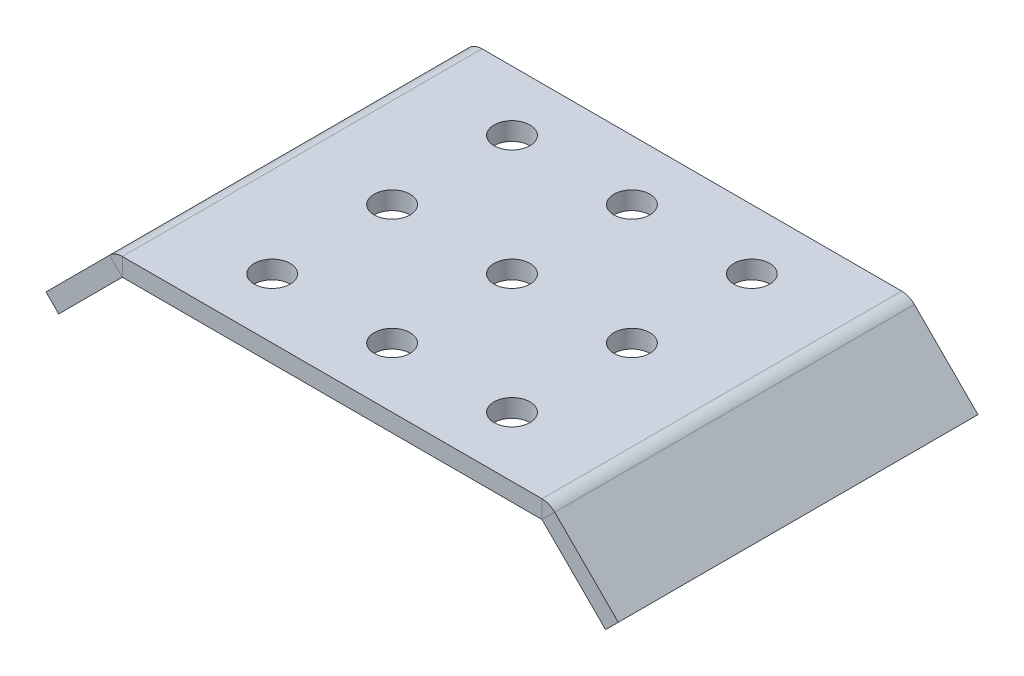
ISO-10303-21;
HEADER;
FILE_DESCRIPTION(('STEP AP214'),'2;1');
FILE_NAME('part.step','',(''),(''),'','','');
FILE_SCHEMA(('AUTOMOTIVE_DESIGN { 1 0 10303 214 1 1 1 1 }'));
ENDSEC;
DATA;
#1=APPLICATION_CONTEXT('core data for automotive mechanical design processes');
#2=APPLICATION_PROTOCOL_DEFINITION('international standard','automotive_design',2000,#1);
#3=PRODUCT_CONTEXT('',#1,'mechanical');
#4=PRODUCT('Part','Part','',(#3));
#5=PRODUCT_RELATED_PRODUCT_CATEGORY('part','',(#4));
#6=PRODUCT_DEFINITION_FORMATION('','',#4);
#7=PRODUCT_DEFINITION_CONTEXT('part definition',#1,'design');
#8=PRODUCT_DEFINITION('design','',#6,#7);
#9=PRODUCT_DEFINITION_SHAPE('','',#8);
#10=(LENGTH_UNIT() NAMED_UNIT(*) SI_UNIT(.MILLI.,.METRE.));
#11=(NAMED_UNIT(*) PLANE_ANGLE_UNIT() SI_UNIT($,.RADIAN.));
#12=(NAMED_UNIT(*) SI_UNIT($,.STERADIAN.) SOLID_ANGLE_UNIT());
#13=UNCERTAINTY_MEASURE_WITH_UNIT(LENGTH_MEASURE(1.E-05),#10,'distance_accuracy_value','');
#14=(GEOMETRIC_REPRESENTATION_CONTEXT(3) GLOBAL_UNCERTAINTY_ASSIGNED_CONTEXT((#13)) GLOBAL_UNIT_ASSIGNED_CONTEXT((#10,
#11,#12)) REPRESENTATION_CONTEXT('',''));
#15=CARTESIAN_POINT('',(0.,0.,0.));
#16=DIRECTION('',(0.,0.,1.));
#17=DIRECTION('',(1.,0.,0.));
#18=AXIS2_PLACEMENT_3D('',#15,#16,#17);
#19=CARTESIAN_POINT('',(0.,0.,-60.));
#20=DIRECTION('',(0.,-1.,0.));
#21=DIRECTION('',(0.,0.,-1.));
#22=AXIS2_PLACEMENT_3D('',#19,#20,#21);
#23=PLANE('',#22);
#24=CARTESIAN_POINT('',(50.,0.,-10.));
#25=DIRECTION('',(0.,1.,0.));
#26=DIRECTION('',(0.,0.,1.));
#27=AXIS2_PLACEMENT_3D('',#24,#25,#26);
#28=CIRCLE('',#27,3.);
#29=CARTESIAN_POINT('',(50.,0.,-7.));
#30=VERTEX_POINT('',#29);
#31=EDGE_CURVE('E237',#30,#30,#28,.T.);
#32=ORIENTED_EDGE('',*,*,#31,.T.);
#33=EDGE_LOOP('',(#32));
#34=FACE_BOUND('',#33,.T.);
#35=CARTESIAN_POINT('',(70.,0.,-50.));
#36=DIRECTION('',(0.,1.,0.));
#37=DIRECTION('',(0.,0.,1.));
#38=AXIS2_PLACEMENT_3D('',#35,#36,#37);
#39=CIRCLE('',#38,3.00000000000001);
#40=CARTESIAN_POINT('',(70.,0.,-47.));
#41=VERTEX_POINT('',#40);
#42=EDGE_CURVE('E249',#41,#41,#39,.T.);
#43=ORIENTED_EDGE('',*,*,#42,.T.);
#44=EDGE_LOOP('',(#43));
#45=FACE_BOUND('',#44,.T.);
#46=CARTESIAN_POINT('',(30.,0.,-50.));
#47=DIRECTION('',(0.,1.,0.));
#48=DIRECTION('',(0.,0.,1.));
#49=AXIS2_PLACEMENT_3D('',#46,#47,#48);
#50=CIRCLE('',#49,3.);
#51=CARTESIAN_POINT('',(30.,0.,-47.));
#52=VERTEX_POINT('',#51);
#53=EDGE_CURVE('E261',#52,#52,#50,.T.);
#54=ORIENTED_EDGE('',*,*,#53,.T.);
#55=EDGE_LOOP('',(#54));
#56=FACE_BOUND('',#55,.T.);
#57=CARTESIAN_POINT('',(50.,0.,-30.));
#58=DIRECTION('',(0.,1.,0.));
#59=DIRECTION('',(0.,0.,1.));
#60=AXIS2_PLACEMENT_3D('',#57,#58,#59);
#61=CIRCLE('',#60,3.);
#62=CARTESIAN_POINT('',(50.,0.,-27.));
#63=VERTEX_POINT('',#62);
#64=EDGE_CURVE('E273',#63,#63,#61,.T.);
#65=ORIENTED_EDGE('',*,*,#64,.T.);
#66=EDGE_LOOP('',(#65));
#67=FACE_BOUND('',#66,.T.);
#68=CARTESIAN_POINT('',(70.,0.,-30.));
#69=DIRECTION('',(0.,1.,0.));
#70=DIRECTION('',(0.,0.,1.));
#71=AXIS2_PLACEMENT_3D('',#68,#69,#70);
#72=CIRCLE('',#71,3.00000000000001);
#73=CARTESIAN_POINT('',(70.,0.,-27.));
#74=VERTEX_POINT('',#73);
#75=EDGE_CURVE('E279',#74,#74,#72,.T.);
#76=ORIENTED_EDGE('',*,*,#75,.T.);
#77=EDGE_LOOP('',(#76));
#78=FACE_BOUND('',#77,.T.);
#79=CARTESIAN_POINT('',(30.,0.,-30.));
#80=DIRECTION('',(0.,1.,0.));
#81=DIRECTION('',(0.,0.,1.));
#82=AXIS2_PLACEMENT_3D('',#79,#80,#81);
#83=CIRCLE('',#82,3.);
#84=CARTESIAN_POINT('',(30.,0.,-27.));
#85=VERTEX_POINT('',#84);
#86=EDGE_CURVE('E267',#85,#85,#83,.T.);
#87=ORIENTED_EDGE('',*,*,#86,.T.);
#88=EDGE_LOOP('',(#87));
#89=FACE_BOUND('',#88,.T.);
#90=CARTESIAN_POINT('',(50.,0.,-50.));
#91=DIRECTION('',(0.,1.,0.));
#92=DIRECTION('',(0.,0.,1.));
#93=AXIS2_PLACEMENT_3D('',#90,#91,#92);
#94=CIRCLE('',#93,3.);
#95=CARTESIAN_POINT('',(50.,0.,-47.));
#96=VERTEX_POINT('',#95);
#97=EDGE_CURVE('E255',#96,#96,#94,.T.);
#98=ORIENTED_EDGE('',*,*,#97,.T.);
#99=EDGE_LOOP('',(#98));
#100=FACE_BOUND('',#99,.T.);
#101=CARTESIAN_POINT('',(70.,0.,-10.));
#102=DIRECTION('',(0.,1.,0.));
#103=DIRECTION('',(0.,0.,1.));
#104=AXIS2_PLACEMENT_3D('',#101,#102,#103);
#105=CIRCLE('',#104,3.00000000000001);
#106=CARTESIAN_POINT('',(70.,0.,-6.99999999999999));
#107=VERTEX_POINT('',#106);
#108=EDGE_CURVE('E243',#107,#107,#105,.T.);
#109=ORIENTED_EDGE('',*,*,#108,.T.);
#110=EDGE_LOOP('',(#109));
#111=FACE_BOUND('',#110,.T.);
#112=CARTESIAN_POINT('',(30.,0.,-10.));
#113=DIRECTION('',(0.,1.,0.));
#114=DIRECTION('',(0.,0.,1.));
#115=AXIS2_PLACEMENT_3D('',#112,#113,#114);
#116=CIRCLE('',#115,3.);
#117=CARTESIAN_POINT('',(30.,0.,-7.));
#118=VERTEX_POINT('',#117);
#119=EDGE_CURVE('E229',#118,#118,#116,.T.);
#120=ORIENTED_EDGE('',*,*,#119,.T.);
#121=EDGE_LOOP('',(#120));
#122=FACE_BOUND('',#121,.T.);
#123=DIRECTION('',(-1.,0.,0.));
#124=VECTOR('',#123,1.);
#125=CARTESIAN_POINT('',(0.,0.,-60.));
#126=LINE('',#125,#124);
#127=CARTESIAN_POINT('',(84.9995955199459,0.,-60.));
#128=VERTEX_POINT('',#127);
#129=CARTESIAN_POINT('',(15.0004044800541,0.,-60.));
#130=VERTEX_POINT('',#129);
#131=EDGE_CURVE('E70',#128,#130,#126,.T.);
#132=ORIENTED_EDGE('',*,*,#131,.F.);
#133=DIRECTION('',(0.,0.,1.));
#134=VECTOR('',#133,1.);
#135=CARTESIAN_POINT('',(84.9995955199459,0.,-60.));
#136=LINE('',#135,#134);
#137=CARTESIAN_POINT('',(84.9995955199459,0.,0.));
#138=VERTEX_POINT('',#137);
#139=EDGE_CURVE('E62',#128,#138,#136,.T.);
#140=ORIENTED_EDGE('',*,*,#139,.T.);
#141=DIRECTION('',(1.,0.,0.));
#142=VECTOR('',#141,1.);
#143=CARTESIAN_POINT('',(0.,0.,0.));
#144=LINE('',#143,#142);
#145=CARTESIAN_POINT('',(15.0004044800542,0.,0.));
#146=VERTEX_POINT('',#145);
#147=EDGE_CURVE('E78',#146,#138,#144,.T.);
#148=ORIENTED_EDGE('',*,*,#147,.F.);
#149=DIRECTION('',(0.,0.,1.));
#150=VECTOR('',#149,1.);
#151=CARTESIAN_POINT('',(15.0004044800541,0.,-60.));
#152=LINE('',#151,#150);
#153=EDGE_CURVE('E293',#130,#146,#152,.T.);
#154=ORIENTED_EDGE('',*,*,#153,.F.);
#155=EDGE_LOOP('',(#132,#140,#148,#154));
#156=FACE_BOUND('',#155,.T.);
#157=ADVANCED_FACE('F53',(#34,#45,#56,#67,#78,#89,#100,#111,#122,#156),#23,.T.);
#158=CARTESIAN_POINT('',(0.,3.,-60.));
#159=DIRECTION('',(0.,0.,1.));
#160=DIRECTION('',(1.,0.,0.));
#161=AXIS2_PLACEMENT_3D('',#158,#159,#160);
#162=PLANE('',#161);
#163=DIRECTION('',(0.,1.,0.));
#164=VECTOR('',#163,1.);
#165=CARTESIAN_POINT('',(84.9995955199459,3.,-60.));
#166=LINE('',#165,#164);
#167=CARTESIAN_POINT('',(84.9995955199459,2.99999999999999,-60.));
#168=VERTEX_POINT('',#167);
#169=EDGE_CURVE('E14',#128,#168,#166,.T.);
#170=ORIENTED_EDGE('',*,*,#169,.F.);
#171=ORIENTED_EDGE('',*,*,#131,.T.);
#172=DIRECTION('',(0.,1.,0.));
#173=VECTOR('',#172,1.);
#174=CARTESIAN_POINT('',(15.0004044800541,3.,-60.));
#175=LINE('',#174,#173);
#176=CARTESIAN_POINT('',(15.0004044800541,3.,-60.));
#177=VERTEX_POINT('',#176);
#178=EDGE_CURVE('E290',#130,#177,#175,.T.);
#179=ORIENTED_EDGE('',*,*,#178,.T.);
#180=DIRECTION('',(-1.,0.,0.));
#181=VECTOR('',#180,1.);
#182=CARTESIAN_POINT('',(0.,3.,-60.));
#183=LINE('',#182,#181);
#184=EDGE_CURVE('E57',#168,#177,#183,.T.);
#185=ORIENTED_EDGE('',*,*,#184,.F.);
#186=EDGE_LOOP('',(#170,#171,#179,#185));
#187=FACE_BOUND('',#186,.T.);
#188=ADVANCED_FACE('F55',(#187),#162,.F.);
#189=CARTESIAN_POINT('',(0.,3.,0.));
#190=DIRECTION('',(0.,0.,-1.));
#191=DIRECTION('',(-1.,0.,0.));
#192=AXIS2_PLACEMENT_3D('',#189,#190,#191);
#193=PLANE('',#192);
#194=DIRECTION('',(0.,-1.,0.));
#195=VECTOR('',#194,1.);
#196=CARTESIAN_POINT('',(84.9995955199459,3.,0.));
#197=LINE('',#196,#195);
#198=CARTESIAN_POINT('',(84.9995955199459,3.,0.));
#199=VERTEX_POINT('',#198);
#200=EDGE_CURVE('E300',#199,#138,#197,.T.);
#201=ORIENTED_EDGE('',*,*,#200,.F.);
#202=DIRECTION('',(1.,0.,0.));
#203=VECTOR('',#202,1.);
#204=CARTESIAN_POINT('',(0.,3.,0.));
#205=LINE('',#204,#203);
#206=CARTESIAN_POINT('',(15.0004044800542,3.,0.));
#207=VERTEX_POINT('',#206);
#208=EDGE_CURVE('E305',#207,#199,#205,.T.);
#209=ORIENTED_EDGE('',*,*,#208,.F.);
#210=DIRECTION('',(0.,-1.,0.));
#211=VECTOR('',#210,1.);
#212=CARTESIAN_POINT('',(15.0004044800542,3.,0.));
#213=LINE('',#212,#211);
#214=EDGE_CURVE('E295',#207,#146,#213,.T.);
#215=ORIENTED_EDGE('',*,*,#214,.T.);
#216=ORIENTED_EDGE('',*,*,#147,.T.);
#217=EDGE_LOOP('',(#201,#209,#215,#216));
#218=FACE_BOUND('',#217,.T.);
#219=ADVANCED_FACE('F352',(#218),#193,.F.);
#220=CARTESIAN_POINT('',(0.,3.,-60.));
#221=DIRECTION('',(0.,-1.,0.));
#222=DIRECTION('',(0.,0.,-1.));
#223=AXIS2_PLACEMENT_3D('',#220,#221,#222);
#224=PLANE('',#223);
#225=DIRECTION('',(0.,0.,1.));
#226=VECTOR('',#225,1.);
#227=CARTESIAN_POINT('',(84.9995955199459,3.,-60.));
#228=LINE('',#227,#226);
#229=EDGE_CURVE('E297',#168,#199,#228,.T.);
#230=ORIENTED_EDGE('',*,*,#229,.F.);
#231=ORIENTED_EDGE('',*,*,#184,.T.);
#232=DIRECTION('',(0.,0.,1.));
#233=VECTOR('',#232,1.);
#234=CARTESIAN_POINT('',(15.0004044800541,3.,-60.));
#235=LINE('',#234,#233);
#236=EDGE_CURVE('E287',#177,#207,#235,.T.);
#237=ORIENTED_EDGE('',*,*,#236,.T.);
#238=ORIENTED_EDGE('',*,*,#208,.T.);
#239=EDGE_LOOP('',(#230,#231,#237,#238));
#240=FACE_BOUND('',#239,.T.);
#241=CARTESIAN_POINT('',(30.,3.,-10.));
#242=DIRECTION('',(0.,1.,0.));
#243=DIRECTION('',(0.,0.,1.));
#244=AXIS2_PLACEMENT_3D('',#241,#242,#243);
#245=CIRCLE('',#244,3.);
#246=CARTESIAN_POINT('',(30.,3.,-7.));
#247=VERTEX_POINT('',#246);
#248=EDGE_CURVE('E234',#247,#247,#245,.T.);
#249=ORIENTED_EDGE('',*,*,#248,.F.);
#250=EDGE_LOOP('',(#249));
#251=FACE_BOUND('',#250,.T.);
#252=CARTESIAN_POINT('',(70.,3.,-10.));
#253=DIRECTION('',(0.,1.,0.));
#254=DIRECTION('',(0.,0.,1.));
#255=AXIS2_PLACEMENT_3D('',#252,#253,#254);
#256=CIRCLE('',#255,3.00000000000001);
#257=CARTESIAN_POINT('',(70.,3.,-6.99999999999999));
#258=VERTEX_POINT('',#257);
#259=EDGE_CURVE('E246',#258,#258,#256,.T.);
#260=ORIENTED_EDGE('',*,*,#259,.F.);
#261=EDGE_LOOP('',(#260));
#262=FACE_BOUND('',#261,.T.);
#263=CARTESIAN_POINT('',(50.,3.,-50.));
#264=DIRECTION('',(0.,1.,0.));
#265=DIRECTION('',(0.,0.,1.));
#266=AXIS2_PLACEMENT_3D('',#263,#264,#265);
#267=CIRCLE('',#266,3.);
#268=CARTESIAN_POINT('',(50.,3.,-47.));
#269=VERTEX_POINT('',#268);
#270=EDGE_CURVE('E258',#269,#269,#267,.T.);
#271=ORIENTED_EDGE('',*,*,#270,.F.);
#272=EDGE_LOOP('',(#271));
#273=FACE_BOUND('',#272,.T.);
#274=CARTESIAN_POINT('',(30.,3.,-30.));
#275=DIRECTION('',(0.,1.,0.));
#276=DIRECTION('',(0.,0.,1.));
#277=AXIS2_PLACEMENT_3D('',#274,#275,#276);
#278=CIRCLE('',#277,3.);
#279=CARTESIAN_POINT('',(30.,3.,-27.));
#280=VERTEX_POINT('',#279);
#281=EDGE_CURVE('E270',#280,#280,#278,.T.);
#282=ORIENTED_EDGE('',*,*,#281,.F.);
#283=EDGE_LOOP('',(#282));
#284=FACE_BOUND('',#283,.T.);
#285=CARTESIAN_POINT('',(70.,3.,-30.));
#286=DIRECTION('',(0.,1.,0.));
#287=DIRECTION('',(0.,0.,1.));
#288=AXIS2_PLACEMENT_3D('',#285,#286,#287);
#289=CIRCLE('',#288,3.00000000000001);
#290=CARTESIAN_POINT('',(70.,3.,-27.));
#291=VERTEX_POINT('',#290);
#292=EDGE_CURVE('E282',#291,#291,#289,.T.);
#293=ORIENTED_EDGE('',*,*,#292,.F.);
#294=EDGE_LOOP('',(#293));
#295=FACE_BOUND('',#294,.T.);
#296=CARTESIAN_POINT('',(50.,3.,-30.));
#297=DIRECTION('',(0.,1.,0.));
#298=DIRECTION('',(0.,0.,1.));
#299=AXIS2_PLACEMENT_3D('',#296,#297,#298);
#300=CIRCLE('',#299,3.);
#301=CARTESIAN_POINT('',(50.,3.,-27.));
#302=VERTEX_POINT('',#301);
#303=EDGE_CURVE('E276',#302,#302,#300,.T.);
#304=ORIENTED_EDGE('',*,*,#303,.F.);
#305=EDGE_LOOP('',(#304));
#306=FACE_BOUND('',#305,.T.);
#307=CARTESIAN_POINT('',(30.,3.,-50.));
#308=DIRECTION('',(0.,1.,0.));
#309=DIRECTION('',(0.,0.,1.));
#310=AXIS2_PLACEMENT_3D('',#307,#308,#309);
#311=CIRCLE('',#310,3.);
#312=CARTESIAN_POINT('',(30.,3.,-47.));
#313=VERTEX_POINT('',#312);
#314=EDGE_CURVE('E264',#313,#313,#311,.T.);
#315=ORIENTED_EDGE('',*,*,#314,.F.);
#316=EDGE_LOOP('',(#315));
#317=FACE_BOUND('',#316,.T.);
#318=CARTESIAN_POINT('',(70.,3.,-50.));
#319=DIRECTION('',(0.,1.,0.));
#320=DIRECTION('',(0.,0.,1.));
#321=AXIS2_PLACEMENT_3D('',#318,#319,#320);
#322=CIRCLE('',#321,3.00000000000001);
#323=CARTESIAN_POINT('',(70.,3.,-47.));
#324=VERTEX_POINT('',#323);
#325=EDGE_CURVE('E252',#324,#324,#322,.T.);
#326=ORIENTED_EDGE('',*,*,#325,.F.);
#327=EDGE_LOOP('',(#326));
#328=FACE_BOUND('',#327,.T.);
#329=CARTESIAN_POINT('',(50.,3.,-10.));
#330=DIRECTION('',(0.,1.,0.));
#331=DIRECTION('',(0.,0.,1.));
#332=AXIS2_PLACEMENT_3D('',#329,#330,#331);
#333=CIRCLE('',#332,3.);
#334=CARTESIAN_POINT('',(50.,3.,-7.));
#335=VERTEX_POINT('',#334);
#336=EDGE_CURVE('E240',#335,#335,#333,.T.);
#337=ORIENTED_EDGE('',*,*,#336,.F.);
#338=EDGE_LOOP('',(#337));
#339=FACE_BOUND('',#338,.T.);
#340=ADVANCED_FACE('F310',(#240,#251,#262,#273,#284,#295,#306,#317,#328,#339),#224,.F.);
#341=CARTESIAN_POINT('',(70.,3.,-30.));
#342=DIRECTION('',(0.,-1.,0.));
#343=DIRECTION('',(0.,0.,-1.));
#344=AXIS2_PLACEMENT_3D('',#341,#342,#343);
#345=CYLINDRICAL_SURFACE('',#344,3.00000000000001);
#346=ORIENTED_EDGE('',*,*,#292,.T.);
#347=EDGE_LOOP('',(#346));
#348=FACE_BOUND('',#347,.T.);
#349=ORIENTED_EDGE('',*,*,#75,.F.);
#350=EDGE_LOOP('',(#349));
#351=FACE_BOUND('',#350,.T.);
#352=ADVANCED_FACE('F359',(#348,#351),#345,.F.);
#353=CARTESIAN_POINT('',(50.,3.,-30.));
#354=DIRECTION('',(0.,-1.,0.));
#355=DIRECTION('',(0.,0.,-1.));
#356=AXIS2_PLACEMENT_3D('',#353,#354,#355);
#357=CYLINDRICAL_SURFACE('',#356,3.);
#358=ORIENTED_EDGE('',*,*,#303,.T.);
#359=EDGE_LOOP('',(#358));
#360=FACE_BOUND('',#359,.T.);
#361=ORIENTED_EDGE('',*,*,#64,.F.);
#362=EDGE_LOOP('',(#361));
#363=FACE_BOUND('',#362,.T.);
#364=ADVANCED_FACE('F362',(#360,#363),#357,.F.);
#365=CARTESIAN_POINT('',(30.,3.,-30.));
#366=DIRECTION('',(0.,-1.,0.));
#367=DIRECTION('',(0.,0.,-1.));
#368=AXIS2_PLACEMENT_3D('',#365,#366,#367);
#369=CYLINDRICAL_SURFACE('',#368,3.);
#370=ORIENTED_EDGE('',*,*,#281,.T.);
#371=EDGE_LOOP('',(#370));
#372=FACE_BOUND('',#371,.T.);
#373=ORIENTED_EDGE('',*,*,#86,.F.);
#374=EDGE_LOOP('',(#373));
#375=FACE_BOUND('',#374,.T.);
#376=ADVANCED_FACE('F366',(#372,#375),#369,.F.);
#377=CARTESIAN_POINT('',(30.,3.,-50.));
#378=DIRECTION('',(0.,-1.,0.));
#379=DIRECTION('',(0.,0.,-1.));
#380=AXIS2_PLACEMENT_3D('',#377,#378,#379);
#381=CYLINDRICAL_SURFACE('',#380,3.);
#382=ORIENTED_EDGE('',*,*,#314,.T.);
#383=EDGE_LOOP('',(#382));
#384=FACE_BOUND('',#383,.T.);
#385=ORIENTED_EDGE('',*,*,#53,.F.);
#386=EDGE_LOOP('',(#385));
#387=FACE_BOUND('',#386,.T.);
#388=ADVANCED_FACE('F370',(#384,#387),#381,.F.);
#389=CARTESIAN_POINT('',(50.,3.,-50.));
#390=DIRECTION('',(0.,-1.,0.));
#391=DIRECTION('',(0.,0.,-1.));
#392=AXIS2_PLACEMENT_3D('',#389,#390,#391);
#393=CYLINDRICAL_SURFACE('',#392,3.);
#394=ORIENTED_EDGE('',*,*,#270,.T.);
#395=EDGE_LOOP('',(#394));
#396=FACE_BOUND('',#395,.T.);
#397=ORIENTED_EDGE('',*,*,#97,.F.);
#398=EDGE_LOOP('',(#397));
#399=FACE_BOUND('',#398,.T.);
#400=ADVANCED_FACE('F374',(#396,#399),#393,.F.);
#401=CARTESIAN_POINT('',(70.,3.,-50.));
#402=DIRECTION('',(0.,-1.,0.));
#403=DIRECTION('',(0.,0.,-1.));
#404=AXIS2_PLACEMENT_3D('',#401,#402,#403);
#405=CYLINDRICAL_SURFACE('',#404,3.00000000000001);
#406=ORIENTED_EDGE('',*,*,#325,.T.);
#407=EDGE_LOOP('',(#406));
#408=FACE_BOUND('',#407,.T.);
#409=ORIENTED_EDGE('',*,*,#42,.F.);
#410=EDGE_LOOP('',(#409));
#411=FACE_BOUND('',#410,.T.);
#412=ADVANCED_FACE('F378',(#408,#411),#405,.F.);
#413=CARTESIAN_POINT('',(70.,3.,-10.));
#414=DIRECTION('',(0.,-1.,0.));
#415=DIRECTION('',(0.,0.,-1.));
#416=AXIS2_PLACEMENT_3D('',#413,#414,#415);
#417=CYLINDRICAL_SURFACE('',#416,3.00000000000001);
#418=ORIENTED_EDGE('',*,*,#259,.T.);
#419=EDGE_LOOP('',(#418));
#420=FACE_BOUND('',#419,.T.);
#421=ORIENTED_EDGE('',*,*,#108,.F.);
#422=EDGE_LOOP('',(#421));
#423=FACE_BOUND('',#422,.T.);
#424=ADVANCED_FACE('F382',(#420,#423),#417,.F.);
#425=CARTESIAN_POINT('',(50.,3.,-10.));
#426=DIRECTION('',(0.,-1.,0.));
#427=DIRECTION('',(0.,0.,-1.));
#428=AXIS2_PLACEMENT_3D('',#425,#426,#427);
#429=CYLINDRICAL_SURFACE('',#428,3.);
#430=ORIENTED_EDGE('',*,*,#336,.T.);
#431=EDGE_LOOP('',(#430));
#432=FACE_BOUND('',#431,.T.);
#433=ORIENTED_EDGE('',*,*,#31,.F.);
#434=EDGE_LOOP('',(#433));
#435=FACE_BOUND('',#434,.T.);
#436=ADVANCED_FACE('F386',(#432,#435),#429,.F.);
#437=CARTESIAN_POINT('',(30.,3.,-10.));
#438=DIRECTION('',(0.,-1.,0.));
#439=DIRECTION('',(0.,0.,-1.));
#440=AXIS2_PLACEMENT_3D('',#437,#438,#439);
#441=CYLINDRICAL_SURFACE('',#440,3.);
#442=ORIENTED_EDGE('',*,*,#248,.T.);
#443=EDGE_LOOP('',(#442));
#444=FACE_BOUND('',#443,.T.);
#445=ORIENTED_EDGE('',*,*,#119,.F.);
#446=EDGE_LOOP('',(#445));
#447=FACE_BOUND('',#446,.T.);
#448=ADVANCED_FACE('F390',(#444,#447),#441,.F.);
#449=CARTESIAN_POINT('',(15.0004044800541,-0.00100000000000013,-60.));
#450=DIRECTION('',(0.,0.,-1.));
#451=DIRECTION('',(-1.,0.,0.));
#452=AXIS2_PLACEMENT_3D('',#449,#450,#451);
#453=PLANE('',#452);
#454=ORIENTED_EDGE('',*,*,#178,.F.);
#455=CARTESIAN_POINT('',(15.0004044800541,-0.00100000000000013,-60.));
#456=DIRECTION('',(0.,0.,1.));
#457=DIRECTION('',(1.,0.,0.));
#458=AXIS2_PLACEMENT_3D('',#455,#456,#457);
#459=CIRCLE('',#458,0.00100000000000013);
#460=CARTESIAN_POINT('',(14.999697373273,-0.00029289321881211,-60.));
#461=VERTEX_POINT('',#460);
#462=EDGE_CURVE('E191',#130,#461,#459,.T.);
#463=ORIENTED_EDGE('',*,*,#462,.T.);
#464=DIRECTION('',(-0.707106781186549,0.707106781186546,0.));
#465=VECTOR('',#464,1.);
#466=CARTESIAN_POINT('',(12.8783770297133,2.12102745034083,-60.));
#467=LINE('',#466,#465);
#468=CARTESIAN_POINT('',(12.8783770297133,2.12102745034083,-60.));
#469=VERTEX_POINT('',#468);
#470=EDGE_CURVE('E214',#461,#469,#467,.T.);
#471=ORIENTED_EDGE('',*,*,#470,.T.);
#472=CARTESIAN_POINT('',(15.0004044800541,-0.00100000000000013,-60.));
#473=DIRECTION('',(0.,0.,1.));
#474=DIRECTION('',(1.,0.,0.));
#475=AXIS2_PLACEMENT_3D('',#472,#473,#474);
#476=CIRCLE('',#475,3.001);
#477=EDGE_CURVE('E222',#177,#469,#476,.T.);
#478=ORIENTED_EDGE('',*,*,#477,.F.);
#479=EDGE_LOOP('',(#454,#463,#471,#478));
#480=FACE_BOUND('',#479,.T.);
#481=ADVANCED_FACE('F316',(#480),#453,.T.);
#482=CARTESIAN_POINT('',(15.0004044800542,-0.00100000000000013,0.));
#483=DIRECTION('',(0.,0.,1.));
#484=DIRECTION('',(1.,0.,0.));
#485=AXIS2_PLACEMENT_3D('',#482,#483,#484);
#486=PLANE('',#485);
#487=DIRECTION('',(0.707106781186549,-0.707106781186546,0.));
#488=VECTOR('',#487,1.);
#489=CARTESIAN_POINT('',(12.8783770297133,2.12102745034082,0.));
#490=LINE('',#489,#488);
#491=CARTESIAN_POINT('',(12.8783770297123,2.12102745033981,0.));
#492=VERTEX_POINT('',#491);
#493=CARTESIAN_POINT('',(14.999697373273,-0.000292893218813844,0.));
#494=VERTEX_POINT('',#493);
#495=EDGE_CURVE('E217',#492,#494,#490,.T.);
#496=ORIENTED_EDGE('',*,*,#495,.T.);
#497=CARTESIAN_POINT('',(15.0004044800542,-0.00100000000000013,0.));
#498=DIRECTION('',(0.,0.,1.));
#499=DIRECTION('',(1.,0.,0.));
#500=AXIS2_PLACEMENT_3D('',#497,#498,#499);
#501=CIRCLE('',#500,0.00100000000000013);
#502=EDGE_CURVE('E226',#494,#146,#501,.F.);
#503=ORIENTED_EDGE('',*,*,#502,.T.);
#504=ORIENTED_EDGE('',*,*,#214,.F.);
#505=CARTESIAN_POINT('',(15.0004044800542,-0.00100000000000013,0.));
#506=DIRECTION('',(0.,0.,-1.));
#507=DIRECTION('',(-1.,0.,0.));
#508=AXIS2_PLACEMENT_3D('',#505,#506,#507);
#509=CIRCLE('',#508,3.001);
#510=EDGE_CURVE('E225',#492,#207,#509,.T.);
#511=ORIENTED_EDGE('',*,*,#510,.F.);
#512=EDGE_LOOP('',(#496,#503,#504,#511));
#513=FACE_BOUND('',#512,.T.);
#514=ADVANCED_FACE('F327',(#513),#486,.T.);
#515=CARTESIAN_POINT('',(15.0004044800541,-0.00100000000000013,-90.074953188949));
#516=DIRECTION('',(0.,0.,1.));
#517=DIRECTION('',(1.,0.,0.));
#518=AXIS2_PLACEMENT_3D('',#515,#516,#517);
#519=CYLINDRICAL_SURFACE('',#518,3.001);
#520=ORIENTED_EDGE('',*,*,#510,.T.);
#521=ORIENTED_EDGE('',*,*,#236,.F.);
#522=ORIENTED_EDGE('',*,*,#477,.T.);
#523=DIRECTION('',(0.,0.,1.));
#524=VECTOR('',#523,1.);
#525=CARTESIAN_POINT('',(12.8783770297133,2.12102745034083,-60.));
#526=LINE('',#525,#524);
#527=EDGE_CURVE('E183',#469,#492,#526,.T.);
#528=ORIENTED_EDGE('',*,*,#527,.T.);
#529=EDGE_LOOP('',(#520,#521,#522,#528));
#530=FACE_BOUND('',#529,.T.);
#531=ADVANCED_FACE('F336',(#530),#519,.T.);
#532=CARTESIAN_POINT('',(15.0004044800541,-0.00100000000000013,-90.074953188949));
#533=DIRECTION('',(0.,0.,1.));
#534=DIRECTION('',(1.,0.,0.));
#535=AXIS2_PLACEMENT_3D('',#532,#533,#534);
#536=CYLINDRICAL_SURFACE('',#535,0.00100000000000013);
#537=ORIENTED_EDGE('',*,*,#502,.F.);
#538=DIRECTION('',(0.,0.,1.));
#539=VECTOR('',#538,1.);
#540=CARTESIAN_POINT('',(14.999697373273,-0.00029289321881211,-60.));
#541=LINE('',#540,#539);
#542=EDGE_CURVE('E195',#461,#494,#541,.T.);
#543=ORIENTED_EDGE('',*,*,#542,.F.);
#544=ORIENTED_EDGE('',*,*,#462,.F.);
#545=ORIENTED_EDGE('',*,*,#153,.T.);
#546=EDGE_LOOP('',(#537,#543,#544,#545));
#547=FACE_BOUND('',#546,.T.);
#548=ADVANCED_FACE('F320',(#547),#536,.F.);
#549=CARTESIAN_POINT('',(2.27206132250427,-8.48528825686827,0.));
#550=DIRECTION('',(0.707106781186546,0.707106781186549,0.));
#551=DIRECTION('',(0.,0.,-1.));
#552=AXIS2_PLACEMENT_3D('',#549,#550,#551);
#553=PLANE('',#552);
#554=DIRECTION('',(0.,0.,1.));
#555=VECTOR('',#554,1.);
#556=CARTESIAN_POINT('',(4.39338166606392,-10.6066086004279,0.));
#557=LINE('',#556,#555);
#558=CARTESIAN_POINT('',(4.39338166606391,-10.6066086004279,-60.));
#559=VERTEX_POINT('',#558);
#560=CARTESIAN_POINT('',(4.39338166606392,-10.6066086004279,0.));
#561=VERTEX_POINT('',#560);
#562=EDGE_CURVE('E211',#559,#561,#557,.T.);
#563=ORIENTED_EDGE('',*,*,#562,.T.);
#564=DIRECTION('',(0.707106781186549,-0.707106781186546,0.));
#565=VECTOR('',#564,1.);
#566=CARTESIAN_POINT('',(2.27206132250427,-8.48528825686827,0.));
#567=LINE('',#566,#565);
#568=CARTESIAN_POINT('',(2.27206132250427,-8.48528825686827,0.));
#569=VERTEX_POINT('',#568);
#570=EDGE_CURVE('E192',#569,#561,#567,.T.);
#571=ORIENTED_EDGE('',*,*,#570,.F.);
#572=DIRECTION('',(0.,0.,1.));
#573=VECTOR('',#572,1.);
#574=CARTESIAN_POINT('',(2.27206132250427,-8.48528825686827,0.));
#575=LINE('',#574,#573);
#576=CARTESIAN_POINT('',(2.27206132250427,-8.48528825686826,-60.));
#577=VERTEX_POINT('',#576);
#578=EDGE_CURVE('E203',#577,#569,#575,.T.);
#579=ORIENTED_EDGE('',*,*,#578,.F.);
#580=DIRECTION('',(0.707106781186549,-0.707106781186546,0.));
#581=VECTOR('',#580,1.);
#582=CARTESIAN_POINT('',(2.27206132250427,-8.48528825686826,-60.));
#583=LINE('',#582,#581);
#584=EDGE_CURVE('E208',#577,#559,#583,.T.);
#585=ORIENTED_EDGE('',*,*,#584,.T.);
#586=EDGE_LOOP('',(#563,#571,#579,#585));
#587=FACE_BOUND('',#586,.T.);
#588=ADVANCED_FACE('F343',(#587),#553,.F.);
#589=CARTESIAN_POINT('',(2.27206132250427,-8.48528825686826,-60.));
#590=DIRECTION('',(0.707106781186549,-0.707106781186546,0.));
#591=DIRECTION('',(0.,0.,-1.));
#592=AXIS2_PLACEMENT_3D('',#589,#590,#591);
#593=PLANE('',#592);
#594=ORIENTED_EDGE('',*,*,#527,.F.);
#595=DIRECTION('',(-0.707106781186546,-0.707106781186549,0.));
#596=VECTOR('',#595,1.);
#597=CARTESIAN_POINT('',(2.27206132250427,-8.48528825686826,-60.));
#598=LINE('',#597,#596);
#599=EDGE_CURVE('E206',#469,#577,#598,.T.);
#600=ORIENTED_EDGE('',*,*,#599,.T.);
#601=ORIENTED_EDGE('',*,*,#578,.T.);
#602=DIRECTION('',(0.707106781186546,0.707106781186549,0.));
#603=VECTOR('',#602,1.);
#604=CARTESIAN_POINT('',(2.27206132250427,-8.48528825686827,0.));
#605=LINE('',#604,#603);
#606=EDGE_CURVE('E200',#569,#492,#605,.T.);
#607=ORIENTED_EDGE('',*,*,#606,.T.);
#608=EDGE_LOOP('',(#594,#600,#601,#607));
#609=FACE_BOUND('',#608,.T.);
#610=ADVANCED_FACE('F331',(#609),#593,.F.);
#611=CARTESIAN_POINT('',(2.27206132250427,-8.48528825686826,-60.));
#612=DIRECTION('',(0.,0.,1.));
#613=DIRECTION('',(0.707106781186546,0.707106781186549,0.));
#614=AXIS2_PLACEMENT_3D('',#611,#612,#613);
#615=PLANE('',#614);
#616=ORIENTED_EDGE('',*,*,#470,.F.);
#617=DIRECTION('',(-0.707106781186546,-0.707106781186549,0.));
#618=VECTOR('',#617,1.);
#619=CARTESIAN_POINT('',(4.39338166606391,-10.6066086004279,-60.));
#620=LINE('',#619,#618);
#621=EDGE_CURVE('E198',#461,#559,#620,.T.);
#622=ORIENTED_EDGE('',*,*,#621,.T.);
#623=ORIENTED_EDGE('',*,*,#584,.F.);
#624=ORIENTED_EDGE('',*,*,#599,.F.);
#625=EDGE_LOOP('',(#616,#622,#623,#624));
#626=FACE_BOUND('',#625,.T.);
#627=ADVANCED_FACE('F439',(#626),#615,.F.);
#628=CARTESIAN_POINT('',(4.39338166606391,-10.6066086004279,-60.));
#629=DIRECTION('',(0.707106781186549,-0.707106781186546,0.));
#630=DIRECTION('',(0.,0.,-1.));
#631=AXIS2_PLACEMENT_3D('',#628,#629,#630);
#632=PLANE('',#631);
#633=ORIENTED_EDGE('',*,*,#621,.F.);
#634=ORIENTED_EDGE('',*,*,#542,.T.);
#635=DIRECTION('',(0.707106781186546,0.707106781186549,0.));
#636=VECTOR('',#635,1.);
#637=CARTESIAN_POINT('',(4.39338166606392,-10.6066086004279,0.));
#638=LINE('',#637,#636);
#639=EDGE_CURVE('E189',#561,#494,#638,.T.);
#640=ORIENTED_EDGE('',*,*,#639,.F.);
#641=ORIENTED_EDGE('',*,*,#562,.F.);
#642=EDGE_LOOP('',(#633,#634,#640,#641));
#643=FACE_BOUND('',#642,.T.);
#644=ADVANCED_FACE('F322',(#643),#632,.T.);
#645=CARTESIAN_POINT('',(2.27206132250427,-8.48528825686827,0.));
#646=DIRECTION('',(0.,0.,-1.));
#647=DIRECTION('',(-0.707106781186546,-0.707106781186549,0.));
#648=AXIS2_PLACEMENT_3D('',#645,#646,#647);
#649=PLANE('',#648);
#650=ORIENTED_EDGE('',*,*,#495,.F.);
#651=ORIENTED_EDGE('',*,*,#606,.F.);
#652=ORIENTED_EDGE('',*,*,#570,.T.);
#653=ORIENTED_EDGE('',*,*,#639,.T.);
#654=EDGE_LOOP('',(#650,#651,#652,#653));
#655=FACE_BOUND('',#654,.T.);
#656=ADVANCED_FACE('F329',(#655),#649,.F.);
#657=CARTESIAN_POINT('',(84.9995955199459,-0.00100000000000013,-60.));
#658=DIRECTION('',(0.,0.,-1.));
#659=DIRECTION('',(-1.,0.,0.));
#660=AXIS2_PLACEMENT_3D('',#657,#658,#659);
#661=PLANE('',#660);
#662=DIRECTION('',(0.707106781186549,0.707106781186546,0.));
#663=VECTOR('',#662,1.);
#664=CARTESIAN_POINT('',(87.1216229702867,2.12102745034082,-60.));
#665=LINE('',#664,#663);
#666=CARTESIAN_POINT('',(85.000302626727,-0.000292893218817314,-60.));
#667=VERTEX_POINT('',#666);
#668=CARTESIAN_POINT('',(87.1216229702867,2.12102745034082,-60.));
#669=VERTEX_POINT('',#668);
#670=EDGE_CURVE('E685',#667,#669,#665,.T.);
#671=ORIENTED_EDGE('',*,*,#670,.F.);
#672=CARTESIAN_POINT('',(84.9995955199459,-0.00100000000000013,-60.));
#673=DIRECTION('',(0.,0.,-1.));
#674=DIRECTION('',(-1.,0.,0.));
#675=AXIS2_PLACEMENT_3D('',#672,#673,#674);
#676=CIRCLE('',#675,0.00100000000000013);
#677=EDGE_CURVE('E185',#667,#128,#676,.F.);
#678=ORIENTED_EDGE('',*,*,#677,.T.);
#679=ORIENTED_EDGE('',*,*,#169,.T.);
#680=CARTESIAN_POINT('',(84.9995955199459,-0.00100000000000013,-60.));
#681=DIRECTION('',(0.,0.,1.));
#682=DIRECTION('',(1.,0.,0.));
#683=AXIS2_PLACEMENT_3D('',#680,#681,#682);
#684=CIRCLE('',#683,3.00099999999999);
#685=EDGE_CURVE('E176',#669,#168,#684,.T.);
#686=ORIENTED_EDGE('',*,*,#685,.F.);
#687=EDGE_LOOP('',(#671,#678,#679,#686));
#688=FACE_BOUND('',#687,.T.);
#689=ADVANCED_FACE('F468',(#688),#661,.T.);
#690=CARTESIAN_POINT('',(84.9995955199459,-0.00100000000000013,0.));
#691=DIRECTION('',(0.,0.,1.));
#692=DIRECTION('',(1.,0.,0.));
#693=AXIS2_PLACEMENT_3D('',#690,#691,#692);
#694=PLANE('',#693);
#695=ORIENTED_EDGE('',*,*,#200,.T.);
#696=CARTESIAN_POINT('',(84.9995955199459,-0.00100000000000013,0.));
#697=DIRECTION('',(0.,0.,-1.));
#698=DIRECTION('',(-1.,0.,0.));
#699=AXIS2_PLACEMENT_3D('',#696,#697,#698);
#700=CIRCLE('',#699,0.00100000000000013);
#701=CARTESIAN_POINT('',(85.0003026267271,-0.000292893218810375,0.));
#702=VERTEX_POINT('',#701);
#703=EDGE_CURVE('E180',#138,#702,#700,.T.);
#704=ORIENTED_EDGE('',*,*,#703,.T.);
#705=DIRECTION('',(-0.707106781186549,-0.707106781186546,0.));
#706=VECTOR('',#705,1.);
#707=CARTESIAN_POINT('',(87.1216229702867,2.12102745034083,0.));
#708=LINE('',#707,#706);
#709=CARTESIAN_POINT('',(87.1216229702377,2.12102745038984,0.));
#710=VERTEX_POINT('',#709);
#711=EDGE_CURVE('E153',#710,#702,#708,.T.);
#712=ORIENTED_EDGE('',*,*,#711,.F.);
#713=CARTESIAN_POINT('',(84.9995955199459,-0.00100000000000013,0.));
#714=DIRECTION('',(0.,0.,-1.));
#715=DIRECTION('',(-1.,0.,0.));
#716=AXIS2_PLACEMENT_3D('',#713,#714,#715);
#717=CIRCLE('',#716,3.001);
#718=EDGE_CURVE('E179',#199,#710,#717,.T.);
#719=ORIENTED_EDGE('',*,*,#718,.F.);
#720=EDGE_LOOP('',(#695,#704,#712,#719));
#721=FACE_BOUND('',#720,.T.);
#722=ADVANCED_FACE('F477',(#721),#694,.T.);
#723=CARTESIAN_POINT('',(84.9995955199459,-0.00100000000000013,30.074953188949));
#724=DIRECTION('',(0.,0.,-1.));
#725=DIRECTION('',(-1.,0.,0.));
#726=AXIS2_PLACEMENT_3D('',#723,#724,#725);
#727=CYLINDRICAL_SURFACE('',#726,3.001);
#728=ORIENTED_EDGE('',*,*,#718,.T.);
#729=DIRECTION('',(0.,0.,1.));
#730=VECTOR('',#729,1.);
#731=CARTESIAN_POINT('',(87.1216229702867,2.12102745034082,-60.));
#732=LINE('',#731,#730);
#733=EDGE_CURVE('E695',#669,#710,#732,.T.);
#734=ORIENTED_EDGE('',*,*,#733,.F.);
#735=ORIENTED_EDGE('',*,*,#685,.T.);
#736=ORIENTED_EDGE('',*,*,#229,.T.);
#737=EDGE_LOOP('',(#728,#734,#735,#736));
#738=FACE_BOUND('',#737,.T.);
#739=ADVANCED_FACE('F488',(#738),#727,.T.);
#740=CARTESIAN_POINT('',(84.9995955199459,-0.00100000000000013,30.074953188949));
#741=DIRECTION('',(0.,0.,-1.));
#742=DIRECTION('',(-1.,0.,0.));
#743=AXIS2_PLACEMENT_3D('',#740,#741,#742);
#744=CYLINDRICAL_SURFACE('',#743,0.00100000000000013);
#745=ORIENTED_EDGE('',*,*,#703,.F.);
#746=ORIENTED_EDGE('',*,*,#139,.F.);
#747=ORIENTED_EDGE('',*,*,#677,.F.);
#748=DIRECTION('',(0.,0.,1.));
#749=VECTOR('',#748,1.);
#750=CARTESIAN_POINT('',(85.000302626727,-0.000292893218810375,-60.));
#751=LINE('',#750,#749);
#752=EDGE_CURVE('E170',#667,#702,#751,.T.);
#753=ORIENTED_EDGE('',*,*,#752,.T.);
#754=EDGE_LOOP('',(#745,#746,#747,#753));
#755=FACE_BOUND('',#754,.T.);
#756=ADVANCED_FACE('F499',(#755),#744,.F.);
#757=CARTESIAN_POINT('',(97.7279386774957,-8.48528825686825,0.));
#758=DIRECTION('',(-0.707106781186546,0.707106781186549,0.));
#759=DIRECTION('',(0.,0.,1.));
#760=AXIS2_PLACEMENT_3D('',#757,#758,#759);
#761=PLANE('',#760);
#762=DIRECTION('',(0.,0.,-1.));
#763=VECTOR('',#762,1.);
#764=CARTESIAN_POINT('',(95.6066183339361,-10.6066086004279,0.));
#765=LINE('',#764,#763);
#766=CARTESIAN_POINT('',(95.6066183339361,-10.6066086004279,0.));
#767=VERTEX_POINT('',#766);
#768=CARTESIAN_POINT('',(95.6066183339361,-10.6066086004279,-60.));
#769=VERTEX_POINT('',#768);
#770=EDGE_CURVE('E163',#767,#769,#765,.T.);
#771=ORIENTED_EDGE('',*,*,#770,.T.);
#772=DIRECTION('',(-0.707106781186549,-0.707106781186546,0.));
#773=VECTOR('',#772,1.);
#774=CARTESIAN_POINT('',(97.7279386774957,-8.48528825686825,-60.));
#775=LINE('',#774,#773);
#776=CARTESIAN_POINT('',(97.7279386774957,-8.48528825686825,-60.));
#777=VERTEX_POINT('',#776);
#778=EDGE_CURVE('E188',#777,#769,#775,.T.);
#779=ORIENTED_EDGE('',*,*,#778,.F.);
#780=DIRECTION('',(0.,0.,-1.));
#781=VECTOR('',#780,1.);
#782=CARTESIAN_POINT('',(97.7279386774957,-8.48528825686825,0.));
#783=LINE('',#782,#781);
#784=CARTESIAN_POINT('',(97.7279386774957,-8.48528825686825,0.));
#785=VERTEX_POINT('',#784);
#786=EDGE_CURVE('E165',#785,#777,#783,.T.);
#787=ORIENTED_EDGE('',*,*,#786,.F.);
#788=DIRECTION('',(-0.707106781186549,-0.707106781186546,0.));
#789=VECTOR('',#788,1.);
#790=CARTESIAN_POINT('',(97.7279386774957,-8.48528825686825,0.));
#791=LINE('',#790,#789);
#792=EDGE_CURVE('E150',#785,#767,#791,.T.);
#793=ORIENTED_EDGE('',*,*,#792,.T.);
#794=EDGE_LOOP('',(#771,#779,#787,#793));
#795=FACE_BOUND('',#794,.T.);
#796=ADVANCED_FACE('F161',(#795),#761,.F.);
#797=CARTESIAN_POINT('',(27.0172605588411,62.2253898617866,-60.));
#798=DIRECTION('',(-0.707106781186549,-0.707106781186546,0.));
#799=DIRECTION('',(0.,0.,-1.));
#800=AXIS2_PLACEMENT_3D('',#797,#798,#799);
#801=PLANE('',#800);
#802=DIRECTION('',(-0.707106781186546,0.707106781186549,0.));
#803=VECTOR('',#802,1.);
#804=CARTESIAN_POINT('',(27.0172605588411,62.2253898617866,-60.));
#805=LINE('',#804,#803);
#806=EDGE_CURVE('E166',#777,#669,#805,.T.);
#807=ORIENTED_EDGE('',*,*,#806,.T.);
#808=ORIENTED_EDGE('',*,*,#733,.T.);
#809=DIRECTION('',(0.707106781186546,-0.707106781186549,0.));
#810=VECTOR('',#809,1.);
#811=CARTESIAN_POINT('',(27.0172605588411,62.2253898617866,0.));
#812=LINE('',#811,#810);
#813=EDGE_CURVE('E696',#710,#785,#812,.T.);
#814=ORIENTED_EDGE('',*,*,#813,.T.);
#815=ORIENTED_EDGE('',*,*,#786,.T.);
#816=EDGE_LOOP('',(#807,#808,#814,#815));
#817=FACE_BOUND('',#816,.T.);
#818=ADVANCED_FACE('F520',(#817),#801,.F.);
#819=CARTESIAN_POINT('',(27.0172605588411,62.2253898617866,0.));
#820=DIRECTION('',(0.,0.,-1.));
#821=DIRECTION('',(-0.707106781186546,0.707106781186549,0.));
#822=AXIS2_PLACEMENT_3D('',#819,#820,#821);
#823=PLANE('',#822);
#824=ORIENTED_EDGE('',*,*,#813,.F.);
#825=ORIENTED_EDGE('',*,*,#711,.T.);
#826=DIRECTION('',(0.707106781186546,-0.707106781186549,0.));
#827=VECTOR('',#826,1.);
#828=CARTESIAN_POINT('',(24.8959402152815,60.104069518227,0.));
#829=LINE('',#828,#827);
#830=EDGE_CURVE('E147',#702,#767,#829,.T.);
#831=ORIENTED_EDGE('',*,*,#830,.T.);
#832=ORIENTED_EDGE('',*,*,#792,.F.);
#833=EDGE_LOOP('',(#824,#825,#831,#832));
#834=FACE_BOUND('',#833,.T.);
#835=ADVANCED_FACE('F149',(#834),#823,.F.);
#836=CARTESIAN_POINT('',(24.8959402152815,60.104069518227,-60.));
#837=DIRECTION('',(-0.707106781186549,-0.707106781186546,0.));
#838=DIRECTION('',(0.,0.,-1.));
#839=AXIS2_PLACEMENT_3D('',#836,#837,#838);
#840=PLANE('',#839);
#841=ORIENTED_EDGE('',*,*,#752,.F.);
#842=DIRECTION('',(-0.707106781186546,0.707106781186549,0.));
#843=VECTOR('',#842,1.);
#844=CARTESIAN_POINT('',(24.8959402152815,60.104069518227,-60.));
#845=LINE('',#844,#843);
#846=EDGE_CURVE('E158',#769,#667,#845,.T.);
#847=ORIENTED_EDGE('',*,*,#846,.F.);
#848=ORIENTED_EDGE('',*,*,#770,.F.);
#849=ORIENTED_EDGE('',*,*,#830,.F.);
#850=EDGE_LOOP('',(#841,#847,#848,#849));
#851=FACE_BOUND('',#850,.T.);
#852=ADVANCED_FACE('F169',(#851),#840,.T.);
#853=CARTESIAN_POINT('',(27.0172605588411,62.2253898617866,-60.));
#854=DIRECTION('',(0.,0.,1.));
#855=DIRECTION('',(0.707106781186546,-0.707106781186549,0.));
#856=AXIS2_PLACEMENT_3D('',#853,#854,#855);
#857=PLANE('',#856);
#858=ORIENTED_EDGE('',*,*,#846,.T.);
#859=ORIENTED_EDGE('',*,*,#670,.T.);
#860=ORIENTED_EDGE('',*,*,#806,.F.);
#861=ORIENTED_EDGE('',*,*,#778,.T.);
#862=EDGE_LOOP('',(#858,#859,#860,#861));
#863=FACE_BOUND('',#862,.T.);
#864=ADVANCED_FACE('F549',(#863),#857,.F.);
#865=CLOSED_SHELL('',(#157,#188,#219,#340,#352,#364,#376,#388,#400,#412,#424,#436,#448,#481,
#514,#531,#548,#588,#610,#627,#644,#656,#689,#722,#739,#756,#796,#818,#835,#852,#864));
#866=MANIFOLD_SOLID_BREP('B2',#865);
#867=ADVANCED_BREP_SHAPE_REPRESENTATION('',(#18,#866),#14);
#868=SHAPE_DEFINITION_REPRESENTATION(#9,#867);
ENDSEC;
END-ISO-10303-21;
